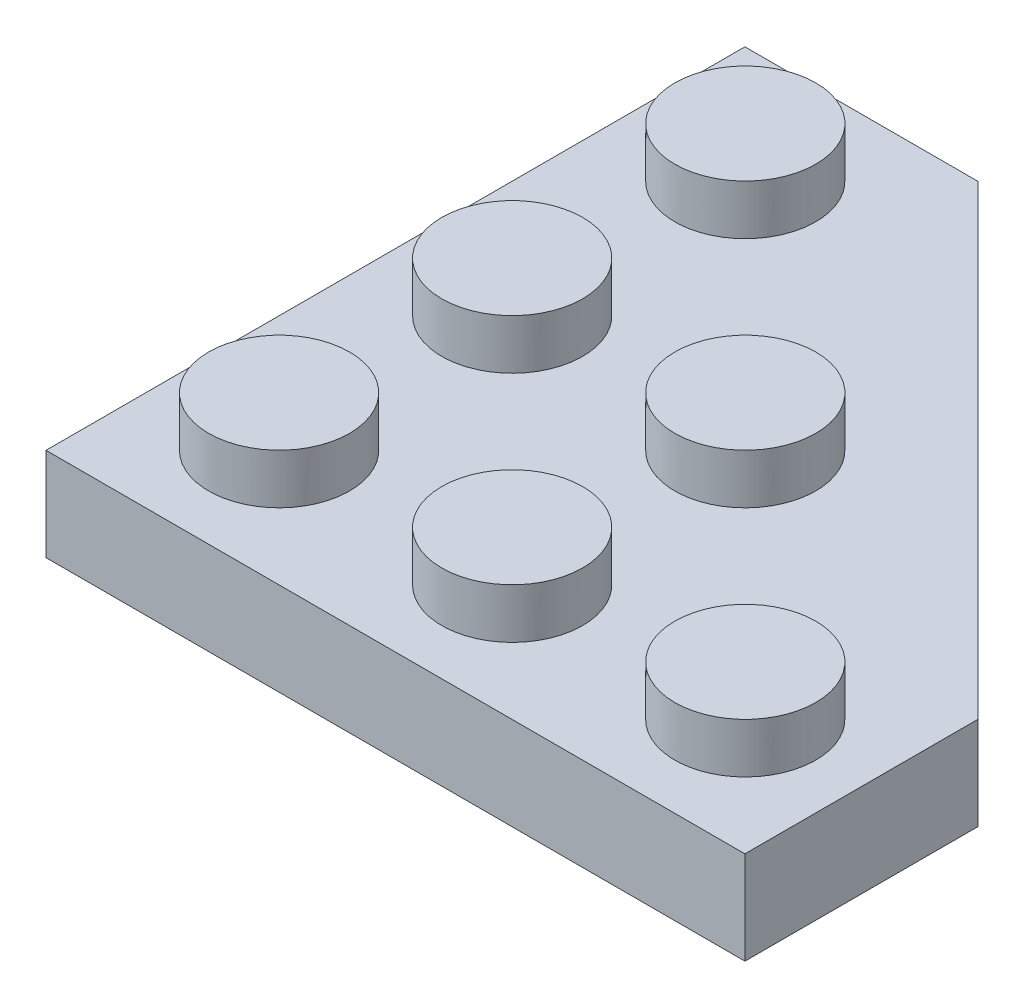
from build123d import *

# Parameters (mm, degrees)
SKETCH1_W                = 23.8
SKETCH1_H                = 23.8
BASE_EXTRUDE_DEPTH       = 3.166
SKETCH2_R                = 2.4
BOSS_EXTRUDE1_DEPTH      = 1.7
LPATTERN4_COUNT          = 3
LPATTERN4_PITCH          = 7.9375
LPATTERN4_COUNT_DIR2     = 3
LPATTERN4_PITCH_DIR2     = 7.9375
CUT_EXTRUDE1_DEPTH       = 18.124355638
SHELL1_T                 = -1.5875
SKETCH3_R                = 3.2004
SKETCH3_R_2              = 2.4384
INSDOT_DEPTH             = 1.5785
SKETCH5_R                = 3.2004
SKETCH5_R_2              = 2.4384
BOSS_EXTRUDE_THIN1_DEPTH = 1.5785
SKETCH6_R                = 3.2004
SKETCH6_R_2              = 2.4384
BOSS_EXTRUDE_THIN2_DEPTH = 1.5785
CUT_EXTRUDE2_START       = -1.5785
CUT_EXTRUDE2_DEPTH       = 1.5785
BOSS_EXTRUDE_THIN3_REACH = 19.519


with BuildPart() as part:
    # Sketch1 → Base-Extrude (new body)
    with BuildSketch(Plane(origin=(0, 0, 0), x_dir=(1, 0, 0), z_dir=(0, 1, 0))):
        Rectangle(SKETCH1_W, SKETCH1_H)
    extrude(amount=BASE_EXTRUDE_DEPTH)

    # Sketch2 → Boss-Extrude1 (add)
    with BuildSketch(Plane(origin=(0, 3.166, 0), x_dir=(-1, 0, 0), z_dir=(0, 1, 0))):
        with Locations(Location((7.93125, 7.93125, 0), (0, 0, 270))):
            Circle(SKETCH2_R)
    boss_extrude1 = extrude(amount=BOSS_EXTRUDE1_DEPTH)

    # LPattern4: Boss-Extrude1 3 × 3, 3 skipped
    with Locations(*[(i * LPATTERN4_PITCH, 0, -j * LPATTERN4_PITCH_DIR2) for i in range(LPATTERN4_COUNT) for j in range(LPATTERN4_COUNT_DIR2) if (i, j) not in ((0, 0), (1, 2), (2, 1), (2, 2))]):
        add(boss_extrude1)

    # Sketch4 → Cut-Extrude1 (cut, through all)
    with BuildSketch(Plane(origin=(0, 3.166, 0), x_dir=(-1, 0, 0), z_dir=(0, 1, 0))):
        Polygon((-11.9, 3.9625), (3.9625, -11.9), (-11.9, -11.9), align=None)
    extrude(amount=-CUT_EXTRUDE1_DEPTH, mode=Mode.SUBTRACT)

    # Shell1
    shell1_openings = [part.faces().sort_by_distance(p)[0] for p in [
        (-1.888010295, 0, 1.888010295),
    ]]
    offset(amount=SHELL1_T, openings=shell1_openings, kind=Kind.INTERSECTION)

    # Sketch3 → InsDot (add)
    with BuildSketch(Plane.XZ.offset(-1.5785)):
        with Locations((-3.965625, -3.971875)):
            Circle(SKETCH3_R)
        with Locations((-3.965625, -3.971875)):
            Circle(SKETCH3_R_2, mode=Mode.SUBTRACT)
    extrude(amount=INSDOT_DEPTH)

    # Sketch5 → Boss-Extrude-Thin1 (add)
    with BuildSketch(Plane(origin=(-0.918447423, 1.5785, 6.872038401), x_dir=(1, 0, 0), z_dir=(0, -1, 0))):
        with Locations((-3.044052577, -2.909538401)):
            Circle(SKETCH5_R)
        with Locations((-3.044052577, -2.909538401)):
            Circle(SKETCH5_R_2, mode=Mode.SUBTRACT)
    extrude(amount=BOSS_EXTRUDE_THIN1_DEPTH)

    # Sketch6 → Boss-Extrude-Thin2 (add)
    with BuildSketch(Plane(origin=(7.701488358, 1.5785, 8.898864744), x_dir=(1, 0, 0), z_dir=(0, -1, 0))):
        with Locations((-3.729613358, -4.933239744)):
            Circle(SKETCH6_R)
        with Locations((-3.729613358, -4.933239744)):
            Circle(SKETCH6_R_2, mode=Mode.SUBTRACT)
    extrude(amount=BOSS_EXTRUDE_THIN2_DEPTH)

    # Sketch7 → Cut-Extrude2 (cut)
    with BuildSketch(Plane.XZ.offset(CUT_EXTRUDE2_START)):
        Polygon((5.540294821, -0.152141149), (6.662826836, -1.274673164), (10.075324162, 2.137824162), (8.952792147, 3.260356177), align=None)
        Polygon((-3.260356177, -8.952792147), (0.152141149, -5.540294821), (1.274673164, -6.662826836), (-2.137824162, -10.075324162), align=None)
    extrude(amount=CUT_EXTRUDE2_DEPTH, mode=Mode.SUBTRACT)

    # Sketch8 → Boss-Extrude-Thin3 (add, up to next)
    with BuildSketch(Plane.XZ, mode=Mode.PRIVATE) as boss_extrude_thin3_sk1:
        Polygon((3.241680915, -2.534574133), (2.343655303, -1.636548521), (1.636548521, -2.343655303), (2.534574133, -3.241680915), align=None)
    boss_extrude_thin3_tool1 = extrude(boss_extrude_thin3_sk1.sketch, amount=-BOSS_EXTRUDE_THIN3_REACH, mode=Mode.PRIVATE) - part.part
    add(boss_extrude_thin3_tool1.solids().sort_by_distance((2.439115, 0, -2.439115))[0])


solid = part.part
